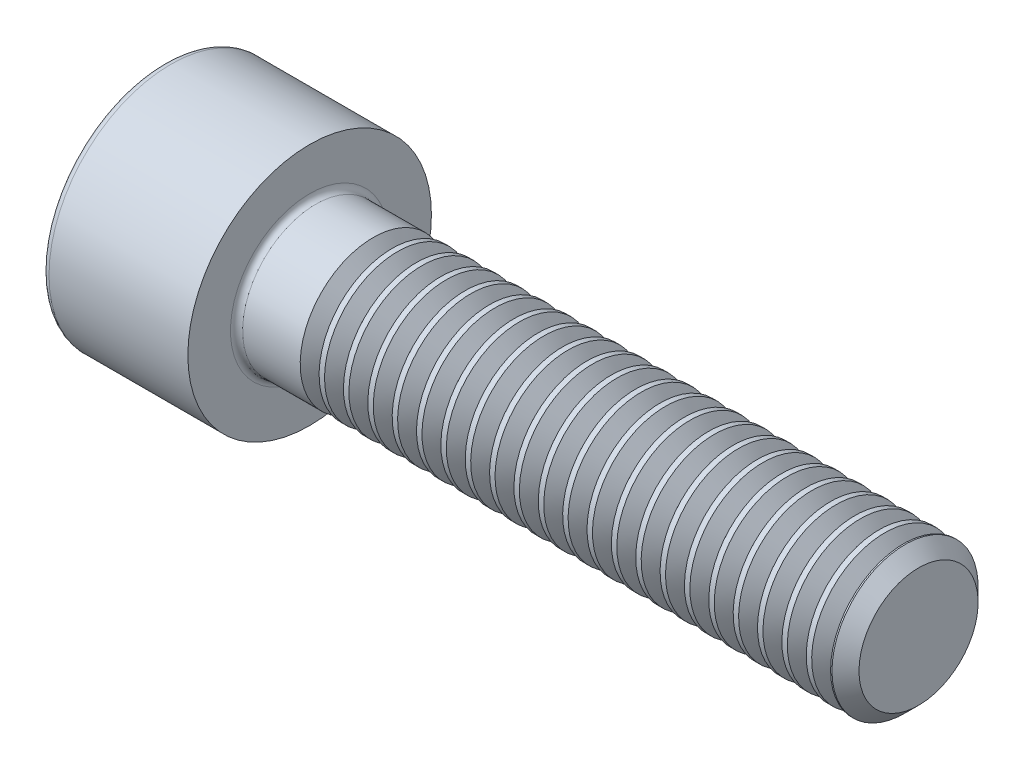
from build123d import *

# Parameters (mm, degrees)
FILLET1_R       = 0.25
FILLET2_R       = 0.3
HEX_2_DEPTH     = 3
THDSCHPAT_COUNT = 22
THDSCHPAT_PITCH = 1


with BuildPart() as part:
    # BodySke → Base-Revolve (revolve)
    with BuildSketch(Plane.XY, mode=Mode.PRIVATE) as base_revolve_sk:
        Polygon((0, 0), (0, 5), (6, 5), (6, 3), (30.4455, 3), (31, 2.4455), (31, 0), align=None)
    revolve(base_revolve_sk.sketch.rotate(Axis((-31.75, 0, 0), (1, 0, 0)), 90), axis=Axis((-31.75, 0, 0), (1, 0, 0)))

    # Fillet1
    fillet1_edges = [part.edges().sort_by_distance(p)[0] for p in [
        (6, 0, -3),
    ]]
    fillet(fillet1_edges, radius=FILLET1_R)

    # Fillet2
    fillet2_edges = [part.edges().sort_by_distance(p)[0] for p in [
        (0, 0, -5),
    ]]
    fillet(fillet2_edges, radius=FILLET2_R)

    # Sketch2 → Hex-PreBroach (revolve, cut)
    with BuildSketch(Plane.XY, mode=Mode.PRIVATE) as hex_prebroach_sk:
        Polygon((0, 2.542), (3, 2.542), (4.467624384, 0), (0, 0), align=None)
    revolve(hex_prebroach_sk.sketch.rotate(Axis((0, 0, 0), (1, 0, 0)), 90), axis=Axis((0, 0, 0), (1, 0, 0)), mode=Mode.SUBTRACT)

    # Sketch3 → Hex 2 (cut)
    with BuildSketch(Plane(origin=(0, 0, 0), x_dir=(0, 0.500000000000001, 0.866025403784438), z_dir=(-1, 0, 0))):
        Polygon((1.467624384, 2.542), (-1.467624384, 2.542), (-2.935248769, 0), (-1.467624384, -2.542), (1.467624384, -2.542), (2.935248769, 0), align=None)
    extrude(amount=-HEX_2_DEPTH, mode=Mode.SUBTRACT)

    # ThdSchSke → ThreadSchematic (revolve, cut)
    with BuildSketch(Plane.XY):
        Polygon((9, -2.4455), (8.61173492, -3), (8.61173492, -3.75), (9.38826508, -3.75), (9.38826508, -3), align=None)
    threadschematic = revolve(axis=Axis((-3.175, 0, 0), (1, 0, 0)), mode=Mode.SUBTRACT)

    # ThdSchPat: ThreadSchematic ×22
    with Locations(*[(i * THDSCHPAT_PITCH, 0, 0) for i in range(1, THDSCHPAT_COUNT)]):
        add(threadschematic, mode=Mode.SUBTRACT)


solid = part.part
